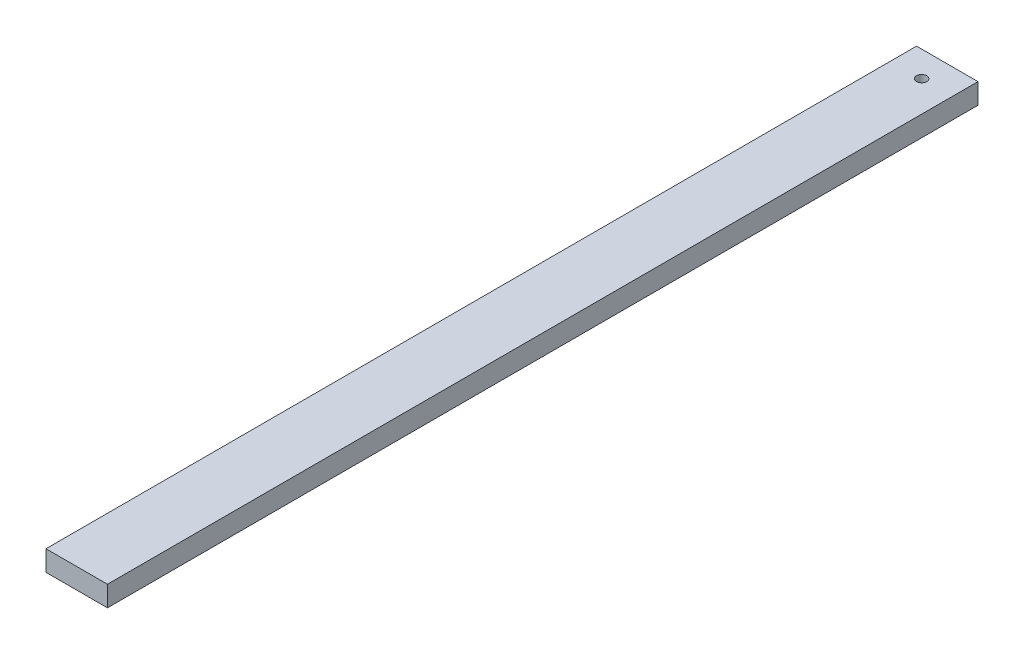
ISO-10303-21;
HEADER;
FILE_DESCRIPTION(('STEP AP214'),'2;1');
FILE_NAME('part.step','',(''),(''),'','','');
FILE_SCHEMA(('AUTOMOTIVE_DESIGN { 1 0 10303 214 1 1 1 1 }'));
ENDSEC;
DATA;
#1=APPLICATION_CONTEXT('core data for automotive mechanical design processes');
#2=APPLICATION_PROTOCOL_DEFINITION('international standard','automotive_design',2000,#1);
#3=PRODUCT_CONTEXT('',#1,'mechanical');
#4=PRODUCT('Part','Part','',(#3));
#5=PRODUCT_RELATED_PRODUCT_CATEGORY('part','',(#4));
#6=PRODUCT_DEFINITION_FORMATION('','',#4);
#7=PRODUCT_DEFINITION_CONTEXT('part definition',#1,'design');
#8=PRODUCT_DEFINITION('design','',#6,#7);
#9=PRODUCT_DEFINITION_SHAPE('','',#8);
#10=(LENGTH_UNIT() NAMED_UNIT(*) SI_UNIT(.MILLI.,.METRE.));
#11=(NAMED_UNIT(*) PLANE_ANGLE_UNIT() SI_UNIT($,.RADIAN.));
#12=(NAMED_UNIT(*) SI_UNIT($,.STERADIAN.) SOLID_ANGLE_UNIT());
#13=UNCERTAINTY_MEASURE_WITH_UNIT(LENGTH_MEASURE(1.E-05),#10,'distance_accuracy_value','');
#14=(GEOMETRIC_REPRESENTATION_CONTEXT(3) GLOBAL_UNCERTAINTY_ASSIGNED_CONTEXT((#13)) GLOBAL_UNIT_ASSIGNED_CONTEXT((#10,
#11,#12)) REPRESENTATION_CONTEXT('',''));
#15=CARTESIAN_POINT('',(0.,0.,0.));
#16=DIRECTION('',(0.,0.,1.));
#17=DIRECTION('',(1.,0.,0.));
#18=AXIS2_PLACEMENT_3D('',#15,#16,#17);
#19=CARTESIAN_POINT('',(-30.,0.,850.));
#20=DIRECTION('',(1.,0.,0.));
#21=DIRECTION('',(0.,0.,-1.));
#22=AXIS2_PLACEMENT_3D('',#19,#20,#21);
#23=PLANE('',#22);
#24=DIRECTION('',(0.,-1.,0.));
#25=VECTOR('',#24,1.);
#26=CARTESIAN_POINT('',(-30.,0.,0.));
#27=LINE('',#26,#25);
#28=CARTESIAN_POINT('',(-30.,20.,0.));
#29=VERTEX_POINT('',#28);
#30=CARTESIAN_POINT('',(-30.,0.,0.));
#31=VERTEX_POINT('',#30);
#32=EDGE_CURVE('E68',#29,#31,#27,.T.);
#33=ORIENTED_EDGE('',*,*,#32,.T.);
#34=DIRECTION('',(0.,0.,-1.));
#35=VECTOR('',#34,1.);
#36=CARTESIAN_POINT('',(-30.,0.,850.));
#37=LINE('',#36,#35);
#38=CARTESIAN_POINT('',(-30.,0.,850.));
#39=VERTEX_POINT('',#38);
#40=EDGE_CURVE('E11',#39,#31,#37,.T.);
#41=ORIENTED_EDGE('',*,*,#40,.F.);
#42=DIRECTION('',(0.,-1.,0.));
#43=VECTOR('',#42,1.);
#44=CARTESIAN_POINT('',(-30.,0.,850.));
#45=LINE('',#44,#43);
#46=CARTESIAN_POINT('',(-30.,20.,850.));
#47=VERTEX_POINT('',#46);
#48=EDGE_CURVE('E91',#47,#39,#45,.T.);
#49=ORIENTED_EDGE('',*,*,#48,.F.);
#50=DIRECTION('',(0.,0.,-1.));
#51=VECTOR('',#50,1.);
#52=CARTESIAN_POINT('',(-30.,20.,850.));
#53=LINE('',#52,#51);
#54=EDGE_CURVE('E80',#47,#29,#53,.T.);
#55=ORIENTED_EDGE('',*,*,#54,.T.);
#56=EDGE_LOOP('',(#33,#41,#49,#55));
#57=FACE_BOUND('',#56,.T.);
#58=ADVANCED_FACE('F24',(#57),#23,.F.);
#59=CARTESIAN_POINT('',(-30.,0.,850.));
#60=DIRECTION('',(0.,1.,0.));
#61=DIRECTION('',(0.,0.,1.));
#62=AXIS2_PLACEMENT_3D('',#59,#60,#61);
#63=PLANE('',#62);
#64=CARTESIAN_POINT('',(-2.1726827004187E-06,0.,24.9999999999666));
#65=DIRECTION('',(0.,1.,0.));
#66=DIRECTION('',(0.,0.,1.));
#67=AXIS2_PLACEMENT_3D('',#64,#65,#66);
#68=CIRCLE('',#67,4.99999999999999);
#69=CARTESIAN_POINT('',(-2.1726827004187E-06,0.,29.9999999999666));
#70=VERTEX_POINT('',#69);
#71=EDGE_CURVE('E81',#70,#70,#68,.T.);
#72=ORIENTED_EDGE('',*,*,#71,.T.);
#73=EDGE_LOOP('',(#72));
#74=FACE_BOUND('',#73,.T.);
#75=DIRECTION('',(1.,0.,0.));
#76=VECTOR('',#75,1.);
#77=CARTESIAN_POINT('',(-30.,0.,0.));
#78=LINE('',#77,#76);
#79=CARTESIAN_POINT('',(30.,0.,0.));
#80=VERTEX_POINT('',#79);
#81=EDGE_CURVE('E64',#31,#80,#78,.T.);
#82=ORIENTED_EDGE('',*,*,#81,.T.);
#83=DIRECTION('',(0.,0.,-1.));
#84=VECTOR('',#83,1.);
#85=CARTESIAN_POINT('',(30.,0.,850.));
#86=LINE('',#85,#84);
#87=CARTESIAN_POINT('',(30.,0.,850.));
#88=VERTEX_POINT('',#87);
#89=EDGE_CURVE('E31',#88,#80,#86,.T.);
#90=ORIENTED_EDGE('',*,*,#89,.F.);
#91=DIRECTION('',(1.,0.,0.));
#92=VECTOR('',#91,1.);
#93=CARTESIAN_POINT('',(-30.,0.,850.));
#94=LINE('',#93,#92);
#95=EDGE_CURVE('E76',#39,#88,#94,.T.);
#96=ORIENTED_EDGE('',*,*,#95,.F.);
#97=ORIENTED_EDGE('',*,*,#40,.T.);
#98=EDGE_LOOP('',(#82,#90,#96,#97));
#99=FACE_BOUND('',#98,.T.);
#100=ADVANCED_FACE('F75',(#74,#99),#63,.F.);
#101=CARTESIAN_POINT('',(30.,0.,850.));
#102=DIRECTION('',(-1.,0.,0.));
#103=DIRECTION('',(0.,0.,1.));
#104=AXIS2_PLACEMENT_3D('',#101,#102,#103);
#105=PLANE('',#104);
#106=DIRECTION('',(0.,1.,0.));
#107=VECTOR('',#106,1.);
#108=CARTESIAN_POINT('',(30.,0.,0.));
#109=LINE('',#108,#107);
#110=CARTESIAN_POINT('',(30.,20.,0.));
#111=VERTEX_POINT('',#110);
#112=EDGE_CURVE('E69',#80,#111,#109,.T.);
#113=ORIENTED_EDGE('',*,*,#112,.T.);
#114=DIRECTION('',(0.,0.,-1.));
#115=VECTOR('',#114,1.);
#116=CARTESIAN_POINT('',(30.,20.,850.));
#117=LINE('',#116,#115);
#118=CARTESIAN_POINT('',(30.,20.,850.));
#119=VERTEX_POINT('',#118);
#120=EDGE_CURVE('E97',#119,#111,#117,.T.);
#121=ORIENTED_EDGE('',*,*,#120,.F.);
#122=DIRECTION('',(0.,1.,0.));
#123=VECTOR('',#122,1.);
#124=CARTESIAN_POINT('',(30.,0.,850.));
#125=LINE('',#124,#123);
#126=EDGE_CURVE('E43',#88,#119,#125,.T.);
#127=ORIENTED_EDGE('',*,*,#126,.F.);
#128=ORIENTED_EDGE('',*,*,#89,.T.);
#129=EDGE_LOOP('',(#113,#121,#127,#128));
#130=FACE_BOUND('',#129,.T.);
#131=ADVANCED_FACE('F100',(#130),#105,.F.);
#132=CARTESIAN_POINT('',(-30.,20.,850.));
#133=DIRECTION('',(0.,-1.,0.));
#134=DIRECTION('',(0.,0.,-1.));
#135=AXIS2_PLACEMENT_3D('',#132,#133,#134);
#136=PLANE('',#135);
#137=CARTESIAN_POINT('',(-2.1726827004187E-06,20.,24.9999999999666));
#138=DIRECTION('',(0.,-1.,0.));
#139=DIRECTION('',(0.,0.,-1.));
#140=AXIS2_PLACEMENT_3D('',#137,#138,#139);
#141=CIRCLE('',#140,4.99999999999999);
#142=CARTESIAN_POINT('',(-2.1726827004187E-06,20.,19.9999999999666));
#143=VERTEX_POINT('',#142);
#144=EDGE_CURVE('E84',#143,#143,#141,.T.);
#145=ORIENTED_EDGE('',*,*,#144,.T.);
#146=EDGE_LOOP('',(#145));
#147=FACE_BOUND('',#146,.T.);
#148=DIRECTION('',(-1.,0.,0.));
#149=VECTOR('',#148,1.);
#150=CARTESIAN_POINT('',(-30.,20.,0.));
#151=LINE('',#150,#149);
#152=EDGE_CURVE('E89',#111,#29,#151,.T.);
#153=ORIENTED_EDGE('',*,*,#152,.T.);
#154=ORIENTED_EDGE('',*,*,#54,.F.);
#155=DIRECTION('',(-1.,0.,0.));
#156=VECTOR('',#155,1.);
#157=CARTESIAN_POINT('',(-30.,20.,850.));
#158=LINE('',#157,#156);
#159=EDGE_CURVE('E38',#119,#47,#158,.T.);
#160=ORIENTED_EDGE('',*,*,#159,.F.);
#161=ORIENTED_EDGE('',*,*,#120,.T.);
#162=EDGE_LOOP('',(#153,#154,#160,#161));
#163=FACE_BOUND('',#162,.T.);
#164=ADVANCED_FACE('F102',(#147,#163),#136,.F.);
#165=CARTESIAN_POINT('',(-30.,20.,850.));
#166=DIRECTION('',(0.,0.,-1.));
#167=DIRECTION('',(-1.,0.,0.));
#168=AXIS2_PLACEMENT_3D('',#165,#166,#167);
#169=PLANE('',#168);
#170=ORIENTED_EDGE('',*,*,#48,.T.);
#171=ORIENTED_EDGE('',*,*,#95,.T.);
#172=ORIENTED_EDGE('',*,*,#126,.T.);
#173=ORIENTED_EDGE('',*,*,#159,.T.);
#174=EDGE_LOOP('',(#170,#171,#172,#173));
#175=FACE_BOUND('',#174,.T.);
#176=ADVANCED_FACE('F103',(#175),#169,.F.);
#177=CARTESIAN_POINT('',(-30.,20.,0.));
#178=DIRECTION('',(0.,0.,-1.));
#179=DIRECTION('',(-1.,0.,0.));
#180=AXIS2_PLACEMENT_3D('',#177,#178,#179);
#181=PLANE('',#180);
#182=ORIENTED_EDGE('',*,*,#32,.F.);
#183=ORIENTED_EDGE('',*,*,#152,.F.);
#184=ORIENTED_EDGE('',*,*,#112,.F.);
#185=ORIENTED_EDGE('',*,*,#81,.F.);
#186=EDGE_LOOP('',(#182,#183,#184,#185));
#187=FACE_BOUND('',#186,.T.);
#188=ADVANCED_FACE('F65',(#187),#181,.T.);
#189=CARTESIAN_POINT('',(-2.1726827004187E-06,-9.99999993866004,24.9999999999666));
#190=DIRECTION('',(0.,-1.,0.));
#191=DIRECTION('',(0.,0.,-1.));
#192=AXIS2_PLACEMENT_3D('',#189,#190,#191);
#193=CYLINDRICAL_SURFACE('',#192,4.99999999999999);
#194=ORIENTED_EDGE('',*,*,#144,.F.);
#195=EDGE_LOOP('',(#194));
#196=FACE_BOUND('',#195,.T.);
#197=ORIENTED_EDGE('',*,*,#71,.F.);
#198=EDGE_LOOP('',(#197));
#199=FACE_BOUND('',#198,.T.);
#200=ADVANCED_FACE('F110',(#196,#199),#193,.F.);
#201=CLOSED_SHELL('',(#58,#100,#131,#164,#176,#188,#200));
#202=MANIFOLD_SOLID_BREP('B2',#201);
#203=ADVANCED_BREP_SHAPE_REPRESENTATION('',(#18,#202),#14);
#204=SHAPE_DEFINITION_REPRESENTATION(#9,#203);
ENDSEC;
END-ISO-10303-21;
